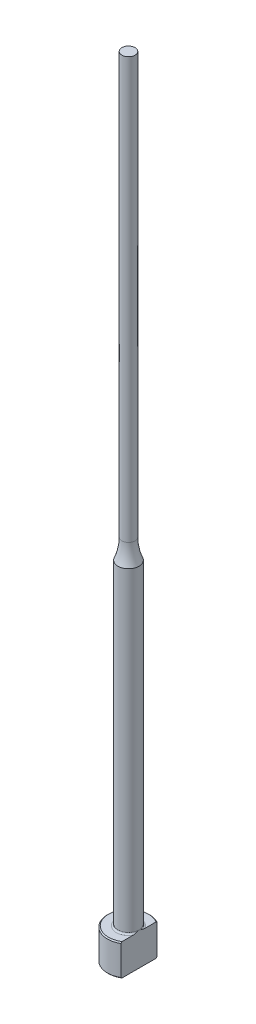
ISO-10303-21;
HEADER;
FILE_DESCRIPTION(('STEP AP214'),'2;1');
FILE_NAME('part.step','',(''),(''),'','','');
FILE_SCHEMA(('AUTOMOTIVE_DESIGN { 1 0 10303 214 1 1 1 1 }'));
ENDSEC;
DATA;
#1=APPLICATION_CONTEXT('core data for automotive mechanical design processes');
#2=APPLICATION_PROTOCOL_DEFINITION('international standard','automotive_design',2000,#1);
#3=PRODUCT_CONTEXT('',#1,'mechanical');
#4=PRODUCT('Part','Part','',(#3));
#5=PRODUCT_RELATED_PRODUCT_CATEGORY('part','',(#4));
#6=PRODUCT_DEFINITION_FORMATION('','',#4);
#7=PRODUCT_DEFINITION_CONTEXT('part definition',#1,'design');
#8=PRODUCT_DEFINITION('design','',#6,#7);
#9=PRODUCT_DEFINITION_SHAPE('','',#8);
#10=(LENGTH_UNIT() NAMED_UNIT(*) SI_UNIT(.MILLI.,.METRE.));
#11=(NAMED_UNIT(*) PLANE_ANGLE_UNIT() SI_UNIT($,.RADIAN.));
#12=(NAMED_UNIT(*) SI_UNIT($,.STERADIAN.) SOLID_ANGLE_UNIT());
#13=UNCERTAINTY_MEASURE_WITH_UNIT(LENGTH_MEASURE(1.E-05),#10,'distance_accuracy_value','');
#14=(GEOMETRIC_REPRESENTATION_CONTEXT(3) GLOBAL_UNCERTAINTY_ASSIGNED_CONTEXT((#13)) GLOBAL_UNIT_ASSIGNED_CONTEXT((#10,
#11,#12)) REPRESENTATION_CONTEXT('',''));
#15=CARTESIAN_POINT('',(0.,0.,0.));
#16=DIRECTION('',(0.,0.,1.));
#17=DIRECTION('',(1.,0.,0.));
#18=AXIS2_PLACEMENT_3D('',#15,#16,#17);
#19=CARTESIAN_POINT('',(-3.99999999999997,6.,0.));
#20=DIRECTION('',(0.,1.,0.));
#21=DIRECTION('',(0.,0.,1.));
#22=AXIS2_PLACEMENT_3D('',#19,#20,#21);
#23=PLANE('',#22);
#24=CARTESIAN_POINT('',(0.,6.,0.));
#25=DIRECTION('',(0.,1.,0.));
#26=DIRECTION('',(0.,0.,1.));
#27=AXIS2_PLACEMENT_3D('',#24,#25,#26);
#28=CIRCLE('',#27,3.79999999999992);
#29=CARTESIAN_POINT('',(1.99999999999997,6.,-3.23109888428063));
#30=VERTEX_POINT('',#29);
#31=CARTESIAN_POINT('',(1.99999999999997,6.,3.23109888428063));
#32=VERTEX_POINT('',#31);
#33=EDGE_CURVE('E187',#30,#32,#28,.T.);
#34=ORIENTED_EDGE('',*,*,#33,.T.);
#35=DIRECTION('',(0.,0.,-1.));
#36=VECTOR('',#35,1.);
#37=CARTESIAN_POINT('',(1.99999999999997,6.,0.));
#38=LINE('',#37,#36);
#39=CARTESIAN_POINT('',(1.99999999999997,5.99999999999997,1.13578166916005));
#40=VERTEX_POINT('',#39);
#41=EDGE_CURVE('E57',#32,#40,#38,.T.);
#42=ORIENTED_EDGE('',*,*,#41,.T.);
#43=CARTESIAN_POINT('',(0.,6.,0.));
#44=DIRECTION('',(0.,1.,0.));
#45=DIRECTION('',(0.,0.,1.));
#46=AXIS2_PLACEMENT_3D('',#43,#44,#45);
#47=CIRCLE('',#46,2.29999999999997);
#48=CARTESIAN_POINT('',(1.99999999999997,5.99999999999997,-1.13578166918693));
#49=VERTEX_POINT('',#48);
#50=EDGE_CURVE('E108',#40,#49,#47,.F.);
#51=ORIENTED_EDGE('',*,*,#50,.T.);
#52=EDGE_CURVE('E137',#49,#30,#38,.T.);
#53=ORIENTED_EDGE('',*,*,#52,.T.);
#54=EDGE_LOOP('',(#34,#42,#51,#53));
#55=FACE_BOUND('',#54,.T.);
#56=ADVANCED_FACE('F32',(#55),#23,.T.);
#57=CARTESIAN_POINT('',(0.,259.958771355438,0.));
#58=DIRECTION('',(0.,1.,0.));
#59=DIRECTION('',(0.,0.,1.));
#60=AXIS2_PLACEMENT_3D('',#57,#58,#59);
#61=CYLINDRICAL_SURFACE('',#60,3.99999999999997);
#62=CARTESIAN_POINT('',(0.,5.79999999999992,0.));
#63=DIRECTION('',(0.,1.,0.));
#64=DIRECTION('',(0.,0.,1.));
#65=AXIS2_PLACEMENT_3D('',#62,#63,#64);
#66=CIRCLE('',#65,3.99999999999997);
#67=CARTESIAN_POINT('',(1.99999999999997,5.79999999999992,3.46410161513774));
#68=VERTEX_POINT('',#67);
#69=CARTESIAN_POINT('',(1.99999999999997,5.79999999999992,-3.46410161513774));
#70=VERTEX_POINT('',#69);
#71=EDGE_CURVE('E105',#68,#70,#66,.F.);
#72=ORIENTED_EDGE('',*,*,#71,.T.);
#73=DIRECTION('',(0.,-1.,0.));
#74=VECTOR('',#73,1.);
#75=CARTESIAN_POINT('',(1.99999999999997,150.,-3.46410161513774));
#76=LINE('',#75,#74);
#77=CARTESIAN_POINT('',(1.99999999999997,0.199999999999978,-3.46410161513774));
#78=VERTEX_POINT('',#77);
#79=EDGE_CURVE('E193',#70,#78,#76,.T.);
#80=ORIENTED_EDGE('',*,*,#79,.T.);
#81=CARTESIAN_POINT('',(0.,0.199999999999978,0.));
#82=DIRECTION('',(0.,-1.,0.));
#83=DIRECTION('',(0.,0.,-1.));
#84=AXIS2_PLACEMENT_3D('',#81,#82,#83);
#85=CIRCLE('',#84,3.99999999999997);
#86=CARTESIAN_POINT('',(1.99999999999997,0.199999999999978,3.46410161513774));
#87=VERTEX_POINT('',#86);
#88=EDGE_CURVE('E100',#78,#87,#85,.F.);
#89=ORIENTED_EDGE('',*,*,#88,.T.);
#90=DIRECTION('',(0.,-1.,0.));
#91=VECTOR('',#90,1.);
#92=CARTESIAN_POINT('',(1.99999999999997,150.,3.46410161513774));
#93=LINE('',#92,#91);
#94=EDGE_CURVE('E93',#68,#87,#93,.T.);
#95=ORIENTED_EDGE('',*,*,#94,.F.);
#96=EDGE_LOOP('',(#72,#80,#89,#95));
#97=FACE_BOUND('',#96,.T.);
#98=ADVANCED_FACE('F158',(#97),#61,.T.);
#99=CARTESIAN_POINT('',(0.,0.,0.));
#100=DIRECTION('',(0.,-1.,0.));
#101=DIRECTION('',(0.,0.,-1.));
#102=AXIS2_PLACEMENT_3D('',#99,#100,#101);
#103=PLANE('',#102);
#104=CARTESIAN_POINT('',(0.,0.,0.));
#105=DIRECTION('',(0.,-1.,0.));
#106=DIRECTION('',(0.,0.,-1.));
#107=AXIS2_PLACEMENT_3D('',#104,#105,#106);
#108=CIRCLE('',#107,3.79999999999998);
#109=CARTESIAN_POINT('',(1.99999999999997,0.,3.2310988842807));
#110=VERTEX_POINT('',#109);
#111=CARTESIAN_POINT('',(1.99999999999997,0.,-3.2310988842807));
#112=VERTEX_POINT('',#111);
#113=EDGE_CURVE('E98',#110,#112,#108,.T.);
#114=ORIENTED_EDGE('',*,*,#113,.T.);
#115=DIRECTION('',(0.,0.,1.));
#116=VECTOR('',#115,1.);
#117=CARTESIAN_POINT('',(1.99999999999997,0.,3.46410161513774));
#118=LINE('',#117,#116);
#119=EDGE_CURVE('E83',#112,#110,#118,.T.);
#120=ORIENTED_EDGE('',*,*,#119,.T.);
#121=EDGE_LOOP('',(#114,#120));
#122=FACE_BOUND('',#121,.T.);
#123=ADVANCED_FACE('F103',(#122),#103,.T.);
#124=CARTESIAN_POINT('',(0.,6.00000000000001,0.));
#125=DIRECTION('',(0.,-1.,0.));
#126=DIRECTION('',(0.,0.,-1.));
#127=AXIS2_PLACEMENT_3D('',#124,#125,#126);
#128=CONICAL_SURFACE('',#127,3.79999999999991,0.785398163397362);
#129=ORIENTED_EDGE('',*,*,#71,.F.);
#130=CARTESIAN_POINT('',(1.99999999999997,1.91904532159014,7.62295524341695));
#131=CARTESIAN_POINT('',(1.99999999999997,2.08611243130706,7.4502239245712));
#132=CARTESIAN_POINT('',(1.99999999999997,2.25300024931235,7.27731861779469));
#133=CARTESIAN_POINT('',(1.99999999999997,2.58631125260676,6.93105655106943));
#134=CARTESIAN_POINT('',(1.99999999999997,2.75273443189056,6.75769978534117));
#135=CARTESIAN_POINT('',(1.99999999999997,3.08509080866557,6.41034692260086));
#136=CARTESIAN_POINT('',(1.99999999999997,3.25102371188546,6.23635054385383));
#137=CARTESIAN_POINT('',(1.99999999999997,3.5821559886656,5.88766284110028));
#138=CARTESIAN_POINT('',(1.99999999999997,3.74735536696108,5.71297152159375));
#139=CARTESIAN_POINT('',(1.99999999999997,4.07353855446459,5.36616839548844));
#140=CARTESIAN_POINT('',(1.99999999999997,4.23454099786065,5.19407412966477));
#141=CARTESIAN_POINT('',(1.99999999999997,4.55534102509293,4.84876663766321));
#142=CARTESIAN_POINT('',(1.99999999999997,4.71513861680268,4.67555341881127));
#143=CARTESIAN_POINT('',(1.99999999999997,5.03306183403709,4.32766569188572));
#144=CARTESIAN_POINT('',(1.99999999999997,5.1911878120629,4.15299150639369));
#145=CARTESIAN_POINT('',(1.99999999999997,5.50513944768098,3.80159134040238));
#146=CARTESIAN_POINT('',(1.99999999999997,5.66096519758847,3.62486544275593));
#147=CARTESIAN_POINT('',(1.99999999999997,5.90974646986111,3.33722425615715));
#148=CARTESIAN_POINT('',(1.99999999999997,6.00376148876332,3.22722645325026));
#149=CARTESIAN_POINT('',(1.99999999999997,6.19011825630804,3.00579987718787));
#150=CARTESIAN_POINT('',(1.99999999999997,6.28245983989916,2.89437096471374));
#151=CARTESIAN_POINT('',(1.99999999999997,6.46586188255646,2.66849662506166));
#152=CARTESIAN_POINT('',(1.99999999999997,6.55689849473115,2.5540317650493));
#153=CARTESIAN_POINT('',(1.99999999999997,6.73578809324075,2.32266819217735));
#154=CARTESIAN_POINT('',(1.99999999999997,6.82364184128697,2.20577007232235));
#155=CARTESIAN_POINT('',(1.99999999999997,6.99612756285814,1.96688707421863));
#156=CARTESIAN_POINT('',(1.99999999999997,7.08069035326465,1.84485190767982));
#157=CARTESIAN_POINT('',(1.99999999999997,7.2430026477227,1.59599329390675));
#158=CARTESIAN_POINT('',(1.99999999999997,7.32074277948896,1.46916359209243));
#159=CARTESIAN_POINT('',(1.99999999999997,7.42869763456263,1.27510066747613));
#160=CARTESIAN_POINT('',(1.99999999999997,7.46305374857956,1.21018943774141));
#161=CARTESIAN_POINT('',(1.99999999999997,7.52837146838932,1.07868835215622));
#162=CARTESIAN_POINT('',(1.99999999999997,7.5593324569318,1.01209819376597));
#163=CARTESIAN_POINT('',(1.99999999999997,7.64566860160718,0.809894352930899));
#164=CARTESIAN_POINT('',(1.99999999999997,7.69478214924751,0.671360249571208));
#165=CARTESIAN_POINT('',(1.99999999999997,7.7479482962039,0.463657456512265));
#166=CARTESIAN_POINT('',(1.99999999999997,7.76205065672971,0.397033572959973));
#167=CARTESIAN_POINT('',(1.99999999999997,7.78390371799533,0.262728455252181));
#168=CARTESIAN_POINT('',(1.99999999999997,7.79165498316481,0.19504731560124));
#169=CARTESIAN_POINT('',(1.99999999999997,7.80025690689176,0.0594528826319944));
#170=CARTESIAN_POINT('',(1.99999999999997,7.80112894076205,-0.00845903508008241));
#171=CARTESIAN_POINT('',(1.99999999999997,7.79596585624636,-0.144020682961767));
#172=CARTESIAN_POINT('',(1.99999999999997,7.78993016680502,-0.211670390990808));
#173=CARTESIAN_POINT('',(1.99999999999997,7.77145363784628,-0.345483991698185));
#174=CARTESIAN_POINT('',(1.99999999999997,7.75906777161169,-0.411655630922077));
#175=CARTESIAN_POINT('',(1.99999999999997,7.72866360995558,-0.542678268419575));
#176=CARTESIAN_POINT('',(1.99999999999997,7.71064463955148,-0.607529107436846));
#177=CARTESIAN_POINT('',(1.99999999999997,7.66972939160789,-0.736064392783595));
#178=CARTESIAN_POINT('',(1.99999999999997,7.64680564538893,-0.799739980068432));
#179=CARTESIAN_POINT('',(1.99999999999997,7.5970014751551,-0.925489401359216));
#180=CARTESIAN_POINT('',(1.99999999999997,7.57012185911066,-0.987563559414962));
#181=CARTESIAN_POINT('',(1.99999999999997,7.48443518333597,-1.17209020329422));
#182=CARTESIAN_POINT('',(1.99999999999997,7.42077407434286,-1.29228210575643));
#183=CARTESIAN_POINT('',(1.99999999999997,7.28502644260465,-1.52785770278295));
#184=CARTESIAN_POINT('',(1.99999999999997,7.21292931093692,-1.6432350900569));
#185=CARTESIAN_POINT('',(1.99999999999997,7.06281517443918,-1.8706938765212));
#186=CARTESIAN_POINT('',(1.99999999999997,6.98477595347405,-1.98276048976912));
#187=CARTESIAN_POINT('',(1.99999999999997,6.82481971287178,-2.20397837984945));
#188=CARTESIAN_POINT('',(1.99999999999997,6.74290465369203,-2.31313108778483));
#189=CARTESIAN_POINT('',(1.99999999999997,6.5751722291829,-2.5306854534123));
#190=CARTESIAN_POINT('',(1.99999999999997,6.48931769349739,-2.63905831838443));
#191=CARTESIAN_POINT('',(1.99999999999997,6.31548151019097,-2.85409686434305));
#192=CARTESIAN_POINT('',(1.99999999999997,6.22749963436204,-2.96076236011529));
#193=CARTESIAN_POINT('',(1.99999999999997,6.0501503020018,-3.17249211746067));
#194=CARTESIAN_POINT('',(1.99999999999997,5.96078672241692,-3.27755963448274));
#195=CARTESIAN_POINT('',(1.99999999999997,5.78082366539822,-3.48663191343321));
#196=CARTESIAN_POINT('',(1.99999999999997,5.69022416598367,-3.59063665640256));
#197=CARTESIAN_POINT('',(1.99999999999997,5.44796733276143,-3.86612439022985));
#198=CARTESIAN_POINT('',(1.99999999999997,5.29545972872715,-4.03685912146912));
#199=CARTESIAN_POINT('',(1.99999999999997,4.98858070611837,-4.37664803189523));
#200=CARTESIAN_POINT('',(1.99999999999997,4.834209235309,-4.54570216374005));
#201=CARTESIAN_POINT('',(1.99999999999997,4.52396102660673,-4.88271638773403));
#202=CARTESIAN_POINT('',(1.99999999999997,4.36808300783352,-5.05067529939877));
#203=CARTESIAN_POINT('',(1.99999999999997,4.05530513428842,-5.38563883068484));
#204=CARTESIAN_POINT('',(1.99999999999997,3.89840527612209,-5.55264344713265));
#205=CARTESIAN_POINT('',(1.99999999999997,3.59029018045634,-5.87905385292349));
#206=CARTESIAN_POINT('',(1.99999999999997,3.43910664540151,-6.03848959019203));
#207=CARTESIAN_POINT('',(1.99999999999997,3.13616436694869,-6.35681456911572));
#208=CARTESIAN_POINT('',(1.99999999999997,2.98440562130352,-6.5157038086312));
#209=CARTESIAN_POINT('',(1.99999999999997,2.68059501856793,-6.83286192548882));
#210=CARTESIAN_POINT('',(1.99999999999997,2.5285436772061,-6.99113129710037));
#211=CARTESIAN_POINT('',(1.99999999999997,2.22406035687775,-7.30730102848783));
#212=CARTESIAN_POINT('',(1.99999999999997,2.07162838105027,-7.46520139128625));
#213=CARTESIAN_POINT('',(1.99999999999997,1.91904532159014,-7.62295524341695));
#214=B_SPLINE_CURVE_WITH_KNOTS('',3,(#130,#131,#132,#133,#134,#135,#136,#137,#138,#139,#140,
#141,#142,#143,#144,#145,#146,#147,#148,#149,#150,#151,#152,#153,#154,#155,#156,#157,#158,#159,
#160,#161,#162,#163,#164,#165,#166,#167,#168,#169,#170,#171,#172,#173,#174,#175,#176,#177,#178,
#179,#180,#181,#182,#183,#184,#185,#186,#187,#188,#189,#190,#191,#192,#193,#194,#195,#196,#197,
#198,#199,#200,#201,#202,#203,#204,#205,#206,#207,#208,#209,#210,#211,#212,#213),.UNSPECIFIED.,
.F.,.F.,(4,2,2,2,2,2,2,2,2,2,2,2,2,2,2,2,2,2,2,2,2,2,2,2,2,2,2,2,2,2,2,2,2,2,2,2,2,2,2,2,2,4),
(0.,0.720921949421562,1.4418531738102,2.16315326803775,2.8844486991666,3.59144103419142,
4.29842874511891,5.00526427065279,5.7120713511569,6.14616174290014,6.58029471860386,
7.01901494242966,7.45762947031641,7.90290456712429,8.34878206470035,8.56901415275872,
8.78928621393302,9.228144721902,9.43219512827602,9.63622739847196,9.83962544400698,
10.0430403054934,10.244723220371,10.4464303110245,10.6492980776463,10.8521244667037,
11.2595582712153,11.6675100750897,12.0770700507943,12.4864250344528,12.9011677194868,
13.3159550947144,13.7297367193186,14.1435257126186,14.8302935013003,15.5170805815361,
16.2045145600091,16.891950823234,17.5511045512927,18.2102608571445,18.8686819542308,
19.5270976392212),.UNSPECIFIED.);
#215=EDGE_CURVE('E136',#68,#32,#214,.T.);
#216=ORIENTED_EDGE('',*,*,#215,.T.);
#217=ORIENTED_EDGE('',*,*,#33,.F.);
#218=EDGE_CURVE('E128',#30,#70,#214,.T.);
#219=ORIENTED_EDGE('',*,*,#218,.T.);
#220=EDGE_LOOP('',(#129,#216,#217,#219));
#221=FACE_BOUND('',#220,.T.);
#222=ADVANCED_FACE('F144',(#221),#128,.T.);
#223=CARTESIAN_POINT('',(0.,0.199999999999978,0.));
#224=DIRECTION('',(0.,1.,0.));
#225=DIRECTION('',(0.,0.,1.));
#226=AXIS2_PLACEMENT_3D('',#223,#224,#225);
#227=CONICAL_SURFACE('',#226,3.99999999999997,0.785398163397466);
#228=ORIENTED_EDGE('',*,*,#88,.F.);
#229=CARTESIAN_POINT('',(1.99999999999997,4.08095467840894,-7.62295524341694));
#230=CARTESIAN_POINT('',(1.99999999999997,3.91388756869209,-7.45022392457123));
#231=CARTESIAN_POINT('',(1.99999999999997,3.74699975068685,-7.27731861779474));
#232=CARTESIAN_POINT('',(1.99999999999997,3.41368874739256,-6.93105655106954));
#233=CARTESIAN_POINT('',(1.99999999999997,3.24726556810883,-6.7576997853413));
#234=CARTESIAN_POINT('',(1.99999999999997,2.91490919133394,-6.41034692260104));
#235=CARTESIAN_POINT('',(1.99999999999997,2.7489762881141,-6.23635054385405));
#236=CARTESIAN_POINT('',(1.99999999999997,2.41784401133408,-5.88766284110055));
#237=CARTESIAN_POINT('',(1.99999999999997,2.25264463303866,-5.71297152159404));
#238=CARTESIAN_POINT('',(1.99999999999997,1.92646144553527,-5.36616839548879));
#239=CARTESIAN_POINT('',(1.99999999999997,1.76545900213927,-5.19407412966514));
#240=CARTESIAN_POINT('',(1.99999999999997,1.44465897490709,-4.84876663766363));
#241=CARTESIAN_POINT('',(1.99999999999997,1.28486138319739,-4.67555341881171));
#242=CARTESIAN_POINT('',(1.99999999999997,0.966938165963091,-4.32766569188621));
#243=CARTESIAN_POINT('',(1.99999999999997,0.808812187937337,-4.1529915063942));
#244=CARTESIAN_POINT('',(1.99999999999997,0.494860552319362,-3.80159134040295));
#245=CARTESIAN_POINT('',(1.99999999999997,0.339034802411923,-3.62486544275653));
#246=CARTESIAN_POINT('',(1.99999999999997,0.0902535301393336,-3.33722425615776));
#247=CARTESIAN_POINT('',(1.99999999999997,-0.0037614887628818,-3.22722645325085));
#248=CARTESIAN_POINT('',(1.99999999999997,-0.190118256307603,-3.00579987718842));
#249=CARTESIAN_POINT('',(1.99999999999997,-0.282459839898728,-2.89437096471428));
#250=CARTESIAN_POINT('',(1.99999999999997,-0.465861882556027,-2.66849662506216));
#251=CARTESIAN_POINT('',(1.99999999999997,-0.556898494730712,-2.55403176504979));
#252=CARTESIAN_POINT('',(1.99999999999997,-0.735788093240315,-2.3226681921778));
#253=CARTESIAN_POINT('',(1.99999999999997,-0.823641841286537,-2.20577007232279));
#254=CARTESIAN_POINT('',(1.99999999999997,-0.996127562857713,-1.96688707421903));
#255=CARTESIAN_POINT('',(1.99999999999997,-1.08069035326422,-1.84485190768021));
#256=CARTESIAN_POINT('',(1.99999999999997,-1.24300264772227,-1.59599329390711));
#257=CARTESIAN_POINT('',(1.99999999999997,-1.32074277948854,-1.46916359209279));
#258=CARTESIAN_POINT('',(1.99999999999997,-1.42869763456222,-1.27510066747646));
#259=CARTESIAN_POINT('',(1.99999999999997,-1.46305374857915,-1.21018943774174));
#260=CARTESIAN_POINT('',(1.99999999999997,-1.52837146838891,-1.07868835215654));
#261=CARTESIAN_POINT('',(1.99999999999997,-1.5593324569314,-1.01209819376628));
#262=CARTESIAN_POINT('',(1.99999999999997,-1.64566860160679,-0.809894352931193));
#263=CARTESIAN_POINT('',(1.99999999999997,-1.69478214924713,-0.671360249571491));
#264=CARTESIAN_POINT('',(1.99999999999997,-1.74794829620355,-0.46365745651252));
#265=CARTESIAN_POINT('',(1.99999999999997,-1.76205065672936,-0.39703357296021));
#266=CARTESIAN_POINT('',(1.99999999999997,-1.783903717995,-0.26272845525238));
#267=CARTESIAN_POINT('',(1.99999999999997,-1.79165498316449,-0.195047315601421));
#268=CARTESIAN_POINT('',(1.99999999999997,-1.80025690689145,-0.0594528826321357));
#269=CARTESIAN_POINT('',(1.99999999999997,-1.80112894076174,0.00845903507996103));
#270=CARTESIAN_POINT('',(1.99999999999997,-1.79596585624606,0.144020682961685));
#271=CARTESIAN_POINT('',(1.99999999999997,-1.78993016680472,0.211670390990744));
#272=CARTESIAN_POINT('',(1.99999999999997,-1.77145363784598,0.345483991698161));
#273=CARTESIAN_POINT('',(1.99999999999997,-1.75906777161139,0.411655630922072));
#274=CARTESIAN_POINT('',(1.99999999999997,-1.72866360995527,0.542678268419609));
#275=CARTESIAN_POINT('',(1.99999999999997,-1.71064463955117,0.607529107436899));
#276=CARTESIAN_POINT('',(1.99999999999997,-1.66972939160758,0.736064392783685));
#277=CARTESIAN_POINT('',(1.99999999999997,-1.64680564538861,0.799739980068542));
#278=CARTESIAN_POINT('',(1.99999999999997,-1.59700147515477,0.925489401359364));
#279=CARTESIAN_POINT('',(1.99999999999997,-1.57012185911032,0.987563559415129));
#280=CARTESIAN_POINT('',(1.99999999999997,-1.4844351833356,1.17209020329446));
#281=CARTESIAN_POINT('',(1.99999999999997,-1.42077407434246,1.29228210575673));
#282=CARTESIAN_POINT('',(1.99999999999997,-1.2850264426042,1.52785770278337));
#283=CARTESIAN_POINT('',(1.99999999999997,-1.21292931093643,1.64323509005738));
#284=CARTESIAN_POINT('',(1.99999999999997,-1.06281517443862,1.87069387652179));
#285=CARTESIAN_POINT('',(1.99999999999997,-0.984775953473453,1.98276048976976));
#286=CARTESIAN_POINT('',(1.99999999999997,-0.824819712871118,2.2039783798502));
#287=CARTESIAN_POINT('',(1.99999999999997,-0.742904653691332,2.31313108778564));
#288=CARTESIAN_POINT('',(1.99999999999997,-0.575172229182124,2.53068545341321));
#289=CARTESIAN_POINT('',(1.99999999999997,-0.489317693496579,2.6390583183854));
#290=CARTESIAN_POINT('',(1.99999999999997,-0.315481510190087,2.85409686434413));
#291=CARTESIAN_POINT('',(1.99999999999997,-0.227499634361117,2.96076236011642));
#292=CARTESIAN_POINT('',(1.99999999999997,-0.0501503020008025,3.17249211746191));
#293=CARTESIAN_POINT('',(1.99999999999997,0.039213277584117,3.27755963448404));
#294=CARTESIAN_POINT('',(1.99999999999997,0.219176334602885,3.48663191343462));
#295=CARTESIAN_POINT('',(1.99999999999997,0.309775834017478,3.59063665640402));
#296=CARTESIAN_POINT('',(1.99999999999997,0.552032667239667,3.86612439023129));
#297=CARTESIAN_POINT('',(1.99999999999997,0.704540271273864,4.03685912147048));
#298=CARTESIAN_POINT('',(1.99999999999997,1.01141929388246,4.37664803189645));
#299=CARTESIAN_POINT('',(1.99999999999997,1.16579076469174,4.54570216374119));
#300=CARTESIAN_POINT('',(1.99999999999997,1.47603897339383,4.88271638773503));
#301=CARTESIAN_POINT('',(1.99999999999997,1.63191699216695,5.0506752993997));
#302=CARTESIAN_POINT('',(1.99999999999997,1.94469486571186,5.38563883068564));
#303=CARTESIAN_POINT('',(1.99999999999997,2.10159472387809,5.55264344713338));
#304=CARTESIAN_POINT('',(1.99999999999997,2.40970981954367,5.87905385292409));
#305=CARTESIAN_POINT('',(1.99999999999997,2.56089335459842,6.03848959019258));
#306=CARTESIAN_POINT('',(1.99999999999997,2.86383563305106,6.35681456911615));
#307=CARTESIAN_POINT('',(1.99999999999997,3.01559437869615,6.51570380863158));
#308=CARTESIAN_POINT('',(1.99999999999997,3.31940498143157,6.83286192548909));
#309=CARTESIAN_POINT('',(1.99999999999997,3.47145632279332,6.99113129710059));
#310=CARTESIAN_POINT('',(1.99999999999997,3.77593964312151,7.30730102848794));
#311=CARTESIAN_POINT('',(1.99999999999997,3.9283716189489,7.4652013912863));
#312=CARTESIAN_POINT('',(1.99999999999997,4.08095467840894,7.62295524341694));
#313=B_SPLINE_CURVE_WITH_KNOTS('',3,(#229,#230,#231,#232,#233,#234,#235,#236,#237,#238,#239,
#240,#241,#242,#243,#244,#245,#246,#247,#248,#249,#250,#251,#252,#253,#254,#255,#256,#257,#258,
#259,#260,#261,#262,#263,#264,#265,#266,#267,#268,#269,#270,#271,#272,#273,#274,#275,#276,#277,
#278,#279,#280,#281,#282,#283,#284,#285,#286,#287,#288,#289,#290,#291,#292,#293,#294,#295,#296,
#297,#298,#299,#300,#301,#302,#303,#304,#305,#306,#307,#308,#309,#310,#311,#312),.UNSPECIFIED.,
.F.,.F.,(4,2,2,2,2,2,2,2,2,2,2,2,2,2,2,2,2,2,2,2,2,2,2,2,2,2,2,2,2,2,2,2,2,2,2,2,2,2,2,2,2,4),
(0.,0.720921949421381,1.44185317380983,2.1631532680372,2.88444869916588,3.59144103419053,
4.29842874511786,5.00526427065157,5.71207135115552,6.1461617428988,6.58029471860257,
7.0190149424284,7.4576294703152,7.90290456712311,8.34878206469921,8.56901415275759,
8.78928621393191,9.22814472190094,9.43219512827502,9.63622739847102,9.83962544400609,
10.0430403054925,10.2447232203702,10.4464303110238,10.6492980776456,10.8521244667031,
11.2595582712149,11.6675100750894,12.0770700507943,12.486425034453,12.9011677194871,
13.3159550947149,13.7297367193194,14.1435257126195,14.8302935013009,15.5170805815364,
16.2045145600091,16.8919508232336,17.551104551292,18.2102608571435,18.8686819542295,
19.5270976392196),.UNSPECIFIED.);
#314=EDGE_CURVE('E86',#78,#112,#313,.T.);
#315=ORIENTED_EDGE('',*,*,#314,.T.);
#316=ORIENTED_EDGE('',*,*,#113,.F.);
#317=EDGE_CURVE('E89',#110,#87,#313,.T.);
#318=ORIENTED_EDGE('',*,*,#317,.T.);
#319=EDGE_LOOP('',(#228,#315,#316,#318));
#320=FACE_BOUND('',#319,.T.);
#321=ADVANCED_FACE('F97',(#320),#227,.T.);
#322=CARTESIAN_POINT('',(0.,6.29999999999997,0.));
#323=DIRECTION('',(0.,1.,0.));
#324=DIRECTION('',(0.,0.,1.));
#325=AXIS2_PLACEMENT_3D('',#322,#323,#324);
#326=TOROIDAL_SURFACE('',#325,2.29999999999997,0.3);
#327=CARTESIAN_POINT('',(1.99999999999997,6.29999999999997,0.));
#328=CARTESIAN_POINT('',(1.99999999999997,6.30000062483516,-7.91120119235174E-11));
#329=CARTESIAN_POINT('',(1.99999999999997,6.3000012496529,-1.38466953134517E-07));
#330=CARTESIAN_POINT('',(1.99999999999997,6.3000024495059,-5.72507056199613E-07));
#331=CARTESIAN_POINT('',(1.99999999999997,6.30000302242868,-8.72848936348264E-07));
#332=CARTESIAN_POINT('',(1.99999999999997,6.30000416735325,-1.59335938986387E-06));
#333=CARTESIAN_POINT('',(1.99999999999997,6.30000473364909,-2.02244692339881E-06));
#334=CARTESIAN_POINT('',(1.99999999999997,6.30000579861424,-2.94494844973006E-06));
#335=CARTESIAN_POINT('',(1.99999999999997,6.30000629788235,-3.4377030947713E-06));
#336=CARTESIAN_POINT('',(1.99999999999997,6.30000798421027,-5.21460072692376E-06));
#337=CARTESIAN_POINT('',(1.99999999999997,6.30000908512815,-6.58180911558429E-06));
#338=CARTESIAN_POINT('',(1.99999999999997,6.30001103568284,-9.3977532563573E-06));
#339=CARTESIAN_POINT('',(1.99999999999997,6.30001189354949,-1.08411101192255E-05));
#340=CARTESIAN_POINT('',(1.99999999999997,6.30001514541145,-1.65122775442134E-05));
#341=CARTESIAN_POINT('',(1.99999999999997,6.30001737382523,-2.08398783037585E-05));
#342=CARTESIAN_POINT('',(1.99999999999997,6.30002099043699,-2.93440763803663E-05));
#343=CARTESIAN_POINT('',(1.99999999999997,6.30002243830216,-3.34960297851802E-05));
#344=CARTESIAN_POINT('',(1.99999999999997,6.30002863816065,-5.12890573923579E-05));
#345=CARTESIAN_POINT('',(1.99999999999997,6.30003337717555,-6.49250938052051E-05));
#346=CARTESIAN_POINT('',(1.99999999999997,6.30004093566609,-9.03829827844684E-05));
#347=CARTESIAN_POINT('',(1.99999999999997,6.30004394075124,-0.000102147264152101));
#348=CARTESIAN_POINT('',(1.99999999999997,6.30006787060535,-0.000188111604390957));
#349=CARTESIAN_POINT('',(1.99999999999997,6.3000985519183,-0.000259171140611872));
#350=CARTESIAN_POINT('',(1.99999999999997,6.30021378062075,-0.00053614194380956));
#351=CARTESIAN_POINT('',(1.99999999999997,6.3002910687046,-0.000744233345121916));
#352=CARTESIAN_POINT('',(1.99999999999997,6.30059644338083,-0.00155446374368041));
#353=CARTESIAN_POINT('',(1.99999999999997,6.30083214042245,-0.00215436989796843));
#354=CARTESIAN_POINT('',(1.99999999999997,6.30179425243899,-0.00461477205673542));
#355=CARTESIAN_POINT('',(1.99999999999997,6.30251207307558,-0.00647773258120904));
#356=CARTESIAN_POINT('',(1.99999999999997,6.31311632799,-0.0339840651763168));
#357=CARTESIAN_POINT('',(1.99999999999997,6.32306890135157,-0.0596088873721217));
#358=CARTESIAN_POINT('',(1.99999999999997,6.34248629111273,-0.109946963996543));
#359=CARTESIAN_POINT('',(1.99999999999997,6.35195547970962,-0.134658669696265));
#360=CARTESIAN_POINT('',(1.99999999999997,6.37186796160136,-0.18704653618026));
#361=CARTESIAN_POINT('',(1.99999999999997,6.38229466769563,-0.214729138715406));
#362=CARTESIAN_POINT('',(1.99999999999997,6.40297705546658,-0.270480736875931));
#363=CARTESIAN_POINT('',(1.99999999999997,6.41322989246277,-0.298550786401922));
#364=CARTESIAN_POINT('',(1.99999999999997,6.43806738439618,-0.36800773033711));
#365=CARTESIAN_POINT('',(1.99999999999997,6.45243182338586,-0.409474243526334));
#366=CARTESIAN_POINT('',(1.99999999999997,6.47965482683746,-0.491807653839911));
#367=CARTESIAN_POINT('',(1.99999999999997,6.49254110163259,-0.532665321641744));
#368=CARTESIAN_POINT('',(1.99999999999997,6.51851192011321,-0.620554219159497));
#369=CARTESIAN_POINT('',(1.99999999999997,6.53137383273,-0.667652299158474));
#370=CARTESIAN_POINT('',(1.99999999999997,6.55459547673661,-0.762854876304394));
#371=CARTESIAN_POINT('',(1.99999999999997,6.5649353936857,-0.810964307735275));
#372=CARTESIAN_POINT('',(1.99999999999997,6.58270957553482,-0.910933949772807));
#373=CARTESIAN_POINT('',(1.99999999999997,6.58991426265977,-0.962836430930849));
#374=CARTESIAN_POINT('',(1.99999999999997,6.59906919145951,-1.06698400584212));
#375=CARTESIAN_POINT('',(1.99999999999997,6.60103790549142,-1.1192272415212));
#376=CARTESIAN_POINT('',(1.99999999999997,6.59819318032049,-1.21399009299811));
#377=CARTESIAN_POINT('',(1.99999999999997,6.59455548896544,-1.2565387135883));
#378=CARTESIAN_POINT('',(1.99999999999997,6.58116512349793,-1.34017723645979));
#379=CARTESIAN_POINT('',(1.99999999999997,6.57150205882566,-1.38127935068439));
#380=CARTESIAN_POINT('',(1.99999999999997,6.55087659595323,-1.44109771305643));
#381=CARTESIAN_POINT('',(1.99999999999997,6.5429124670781,-1.46084510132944));
#382=CARTESIAN_POINT('',(1.99999999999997,6.52453399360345,-1.49924523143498));
#383=CARTESIAN_POINT('',(1.99999999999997,6.51411538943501,-1.51789599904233));
#384=CARTESIAN_POINT('',(1.99999999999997,6.49255299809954,-1.55022658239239));
#385=CARTESIAN_POINT('',(1.99999999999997,6.48185951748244,-1.56420357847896));
#386=CARTESIAN_POINT('',(1.99999999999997,6.45839348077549,-1.5902875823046));
#387=CARTESIAN_POINT('',(1.99999999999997,6.445625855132,-1.60239889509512));
#388=CARTESIAN_POINT('',(1.99999999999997,6.4218327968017,-1.62093425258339));
#389=CARTESIAN_POINT('',(1.99999999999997,6.41131183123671,-1.6280029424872));
#390=CARTESIAN_POINT('',(1.99999999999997,6.38926242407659,-1.64036132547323));
#391=CARTESIAN_POINT('',(1.99999999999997,6.37773458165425,-1.64565206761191));
#392=CARTESIAN_POINT('',(1.99999999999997,6.35379760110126,-1.65410966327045));
#393=CARTESIAN_POINT('',(1.99999999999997,6.34138166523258,-1.65725762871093));
#394=CARTESIAN_POINT('',(1.99999999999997,6.31617371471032,-1.66106000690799));
#395=CARTESIAN_POINT('',(1.99999999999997,6.3033820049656,-1.66171638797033));
#396=CARTESIAN_POINT('',(1.99999999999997,6.27959278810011,-1.66055848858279));
#397=CARTESIAN_POINT('',(1.99999999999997,6.26857876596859,-1.6590551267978));
#398=CARTESIAN_POINT('',(1.99999999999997,6.24695777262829,-1.65423593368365));
#399=CARTESIAN_POINT('',(1.99999999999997,6.23635086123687,-1.65091983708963));
#400=CARTESIAN_POINT('',(1.99999999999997,6.21566894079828,-1.64264699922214));
#401=CARTESIAN_POINT('',(1.99999999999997,6.20560117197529,-1.63767239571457));
#402=CARTESIAN_POINT('',(1.99999999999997,6.18626855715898,-1.626364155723));
#403=CARTESIAN_POINT('',(1.99999999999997,6.17700400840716,-1.62003001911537));
#404=CARTESIAN_POINT('',(1.99999999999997,6.15429988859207,-1.60233802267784));
#405=CARTESIAN_POINT('',(1.99999999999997,6.14148777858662,-1.59017362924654));
#406=CARTESIAN_POINT('',(1.99999999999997,6.11794267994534,-1.56396532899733));
#407=CARTESIAN_POINT('',(1.99999999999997,6.10721625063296,-1.54991572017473));
#408=CARTESIAN_POINT('',(1.99999999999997,6.08234423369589,-1.51253200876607));
#409=CARTESIAN_POINT('',(1.99999999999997,6.06952968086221,-1.48831711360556));
#410=CARTESIAN_POINT('',(1.99999999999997,6.04773953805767,-1.43832020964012));
#411=CARTESIAN_POINT('',(1.99999999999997,6.03876197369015,-1.41253901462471));
#412=CARTESIAN_POINT('',(1.99999999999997,6.01850750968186,-1.3410181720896));
#413=CARTESIAN_POINT('',(1.99999999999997,6.01031623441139,-1.29441496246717));
#414=CARTESIAN_POINT('',(1.99999999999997,6.00061264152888,-1.19993212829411));
#415=CARTESIAN_POINT('',(1.99999999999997,5.99920833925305,-1.15204398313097));
#416=CARTESIAN_POINT('',(1.99999999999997,6.001930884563,-1.04246961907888));
#417=CARTESIAN_POINT('',(1.99999999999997,6.00779200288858,-0.980836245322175));
#418=CARTESIAN_POINT('',(1.99999999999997,6.0256292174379,-0.858294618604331));
#419=CARTESIAN_POINT('',(1.99999999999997,6.03763032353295,-0.797390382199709));
#420=CARTESIAN_POINT('',(1.99999999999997,6.0649490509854,-0.681046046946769));
#421=CARTESIAN_POINT('',(1.99999999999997,6.07996031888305,-0.625531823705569));
#422=CARTESIAN_POINT('',(1.99999999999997,6.11250087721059,-0.515805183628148));
#423=CARTESIAN_POINT('',(1.99999999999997,6.13000629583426,-0.461585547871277));
#424=CARTESIAN_POINT('',(1.99999999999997,6.15814737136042,-0.379074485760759));
#425=CARTESIAN_POINT('',(1.99999999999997,6.16814918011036,-0.350562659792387));
#426=CARTESIAN_POINT('',(1.99999999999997,6.18879761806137,-0.29295407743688));
#427=CARTESIAN_POINT('',(1.99999999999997,6.19945417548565,-0.263860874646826));
#428=CARTESIAN_POINT('',(1.99999999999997,6.21767622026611,-0.214869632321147));
#429=CARTESIAN_POINT('',(1.99999999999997,6.22516548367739,-0.19494302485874));
#430=CARTESIAN_POINT('',(1.99999999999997,6.24017206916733,-0.155327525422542));
#431=CARTESIAN_POINT('',(1.99999999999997,6.24768836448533,-0.135638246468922));
#432=CARTESIAN_POINT('',(1.99999999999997,6.26198776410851,-0.0983447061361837));
#433=CARTESIAN_POINT('',(1.99999999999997,6.26876515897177,-0.0807381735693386));
#434=CARTESIAN_POINT('',(1.99999999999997,6.2826325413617,-0.0448719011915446));
#435=CARTESIAN_POINT('',(1.99999999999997,6.28972459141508,-0.0266128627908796));
#436=CARTESIAN_POINT('',(1.99999999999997,6.29748742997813,-0.0064792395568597));
#437=CARTESIAN_POINT('',(1.99999999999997,6.29820461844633,-0.00461774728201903));
#438=CARTESIAN_POINT('',(1.99999999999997,6.29916656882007,-0.00215769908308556));
#439=CARTESIAN_POINT('',(1.99999999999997,6.29940270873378,-0.0015566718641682));
#440=CARTESIAN_POINT('',(1.99999999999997,6.29970861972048,-0.000745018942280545));
#441=CARTESIAN_POINT('',(1.99999999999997,6.29978601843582,-0.000536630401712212));
#442=CARTESIAN_POINT('',(1.99999999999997,6.29990139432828,-0.000259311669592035));
#443=CARTESIAN_POINT('',(1.99999999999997,6.29993209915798,-0.000188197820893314));
#444=CARTESIAN_POINT('',(1.99999999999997,6.29995604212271,-0.00010217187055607));
#445=CARTESIAN_POINT('',(1.99999999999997,6.29995904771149,-9.04035945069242E-05));
#446=CARTESIAN_POINT('',(1.99999999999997,6.29996660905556,-6.49368762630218E-05));
#447=CARTESIAN_POINT('',(1.99999999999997,6.2999713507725,-5.12961131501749E-05));
#448=CARTESIAN_POINT('',(1.99999999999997,6.29997755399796,-3.34977849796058E-05));
#449=CARTESIAN_POINT('',(1.99999999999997,6.29997900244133,-2.93452179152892E-05));
#450=CARTESIAN_POINT('',(1.99999999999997,6.29998262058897,-2.08398568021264E-05));
#451=CARTESIAN_POINT('',(1.99999999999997,6.2999848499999,-1.65117298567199E-05));
#452=CARTESIAN_POINT('',(1.99999999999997,6.29998810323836,-1.08400636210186E-05));
#453=CARTESIAN_POINT('',(1.99999999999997,6.29998896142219,-9.39665904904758E-06));
#454=CARTESIAN_POINT('',(1.99999999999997,6.29999091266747,-6.58068188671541E-06));
#455=CARTESIAN_POINT('',(1.99999999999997,6.29999201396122,-5.21349162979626E-06));
#456=CARTESIAN_POINT('',(1.99999999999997,6.29999370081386,-3.43669337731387E-06));
#457=CARTESIAN_POINT('',(1.99999999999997,6.29999420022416,-2.94398228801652E-06));
#458=CARTESIAN_POINT('',(1.99999999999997,6.29999526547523,-2.02159337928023E-06));
#459=CARTESIAN_POINT('',(1.99999999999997,6.29999583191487,-1.59257522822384E-06));
#460=CARTESIAN_POINT('',(1.99999999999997,6.29999697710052,-8.72232367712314E-07));
#461=CARTESIAN_POINT('',(1.99999999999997,6.29999755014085,-5.71985037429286E-07));
#462=CARTESIAN_POINT('',(1.99999999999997,6.29999875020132,-1.38175023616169E-07));
#463=CARTESIAN_POINT('',(1.99999999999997,6.29999937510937,7.91190278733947E-11));
#464=CARTESIAN_POINT('',(1.99999999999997,6.29999999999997,0.));
#465=B_SPLINE_CURVE_WITH_KNOTS('',3,(#327,#328,#329,#330,#331,#332,#333,#334,#335,#336,#337,
#338,#339,#340,#341,#342,#343,#344,#345,#346,#347,#348,#349,#350,#351,#352,#353,#354,#355,#356,
#357,#358,#359,#360,#361,#362,#363,#364,#365,#366,#367,#368,#369,#370,#371,#372,#373,#374,#375,
#376,#377,#378,#379,#380,#381,#382,#383,#384,#385,#386,#387,#388,#389,#390,#391,#392,#393,#394,
#395,#396,#397,#398,#399,#400,#401,#402,#403,#404,#405,#406,#407,#408,#409,#410,#411,#412,#413,
#414,#415,#416,#417,#418,#419,#420,#421,#422,#423,#424,#425,#426,#427,#428,#429,#430,#431,#432,
#433,#434,#435,#436,#437,#438,#439,#440,#441,#442,#443,#444,#445,#446,#447,#448,#449,#450,#451,
#452,#453,#454,#455,#456,#457,#458,#459,#460,#461,#462,#463,#464),.UNSPECIFIED.,.T.,.F.,(4,2,2,
2,2,2,2,2,2,2,2,2,2,2,2,2,2,2,2,2,2,2,2,2,2,2,2,2,2,2,2,2,2,2,2,2,2,2,2,2,2,2,2,2,2,2,2,2,2,2,2,
2,2,2,2,2,2,2,2,2,2,2,2,2,2,2,2,2,4),(0.,1.87392281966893E-06,3.80527467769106E-06,
5.92782295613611E-06,8.02992841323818E-06,1.32707961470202E-05,1.83039487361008E-05,
3.28629525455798E-05,4.60403129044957E-05,8.93409891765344E-05,0.000125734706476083,
0.000357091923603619,0.00102372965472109,0.00295649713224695,0.00894682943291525,
0.0914075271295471,0.170800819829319,0.259542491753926,0.349192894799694,0.480831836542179,
0.609336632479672,0.755749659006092,0.90327840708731,1.06029304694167,1.2167530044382,
1.34456674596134,1.47052354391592,1.53427785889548,1.59814364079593,1.65076980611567,
1.70327265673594,1.74115950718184,1.7790239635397,1.81721800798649,1.85538187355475,
1.88857073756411,1.92176445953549,1.95532789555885,1.98890369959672,2.04160283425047,
2.09446511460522,2.17619131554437,2.25787541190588,2.39903747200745,2.54243890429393,
2.72770087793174,2.91372355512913,3.08615579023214,3.2570365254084,3.34768022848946,
3.44062797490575,3.50449043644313,3.56771526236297,3.62431442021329,3.68307253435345,
3.68905809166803,3.69099447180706,3.69166206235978,3.69189359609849,3.69193000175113,
3.69197331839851,3.69198649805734,3.69200105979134,3.69200609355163,3.69201133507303,
3.69201343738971,3.69201556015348,3.69201749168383,3.69201936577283),.UNSPECIFIED.);
#466=CARTESIAN_POINT('',(1.99999999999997,6.29999999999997,0.));
#467=VERTEX_POINT('',#466);
#468=EDGE_CURVE('E11',#49,#467,#465,.T.);
#469=ORIENTED_EDGE('',*,*,#468,.F.);
#470=ORIENTED_EDGE('',*,*,#50,.F.);
#471=CARTESIAN_POINT('',(1.99999999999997,6.29999999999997,0.));
#472=CARTESIAN_POINT('',(1.99999999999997,6.29999937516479,7.91119678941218E-11));
#473=CARTESIAN_POINT('',(1.99999999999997,6.29999875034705,1.38466953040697E-07));
#474=CARTESIAN_POINT('',(1.99999999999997,6.29999755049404,5.72507056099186E-07));
#475=CARTESIAN_POINT('',(1.99999999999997,6.29999697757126,8.72848936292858E-07));
#476=CARTESIAN_POINT('',(1.99999999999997,6.29999583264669,1.5933593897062E-06));
#477=CARTESIAN_POINT('',(1.99999999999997,6.29999526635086,2.02244692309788E-06));
#478=CARTESIAN_POINT('',(1.99999999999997,6.29999420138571,2.94494844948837E-06));
#479=CARTESIAN_POINT('',(1.99999999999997,6.29999370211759,3.43770309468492E-06));
#480=CARTESIAN_POINT('',(1.99999999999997,6.29999201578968,5.2146007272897E-06));
#481=CARTESIAN_POINT('',(1.99999999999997,6.29999091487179,6.58180911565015E-06));
#482=CARTESIAN_POINT('',(1.99999999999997,6.29998896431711,9.39775325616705E-06));
#483=CARTESIAN_POINT('',(1.99999999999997,6.29998810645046,1.08411101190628E-05));
#484=CARTESIAN_POINT('',(1.99999999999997,6.2999848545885,1.65122775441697E-05));
#485=CARTESIAN_POINT('',(1.99999999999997,6.29998262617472,2.08398783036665E-05));
#486=CARTESIAN_POINT('',(1.99999999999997,6.29997900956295,2.93440763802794E-05));
#487=CARTESIAN_POINT('',(1.99999999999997,6.29997756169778,3.34960297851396E-05));
#488=CARTESIAN_POINT('',(1.99999999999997,6.2999713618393,5.12890573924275E-05));
#489=CARTESIAN_POINT('',(1.99999999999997,6.2999666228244,6.49250938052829E-05));
#490=CARTESIAN_POINT('',(1.99999999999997,6.29995906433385,9.03829827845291E-05));
#491=CARTESIAN_POINT('',(1.99999999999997,6.2999560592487,0.000102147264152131));
#492=CARTESIAN_POINT('',(1.99999999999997,6.29993212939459,0.000188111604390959));
#493=CARTESIAN_POINT('',(1.99999999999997,6.29990144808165,0.000259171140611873));
#494=CARTESIAN_POINT('',(1.99999999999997,6.2997862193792,0.000536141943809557));
#495=CARTESIAN_POINT('',(1.99999999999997,6.29970893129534,0.000744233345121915));
#496=CARTESIAN_POINT('',(1.99999999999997,6.29940355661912,0.00155446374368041));
#497=CARTESIAN_POINT('',(1.99999999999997,6.29916785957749,0.00215436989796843));
#498=CARTESIAN_POINT('',(1.99999999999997,6.29820574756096,0.00461477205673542));
#499=CARTESIAN_POINT('',(1.99999999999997,6.29748792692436,0.00647773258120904));
#500=CARTESIAN_POINT('',(1.99999999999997,6.28688367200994,0.0339840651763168));
#501=CARTESIAN_POINT('',(1.99999999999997,6.27693109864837,0.0596088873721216));
#502=CARTESIAN_POINT('',(1.99999999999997,6.25751370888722,0.109946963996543));
#503=CARTESIAN_POINT('',(1.99999999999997,6.24804452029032,0.134658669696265));
#504=CARTESIAN_POINT('',(1.99999999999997,6.22813203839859,0.187046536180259));
#505=CARTESIAN_POINT('',(1.99999999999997,6.21770533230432,0.214729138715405));
#506=CARTESIAN_POINT('',(1.99999999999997,6.19702294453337,0.270480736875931));
#507=CARTESIAN_POINT('',(1.99999999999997,6.18677010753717,0.298550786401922));
#508=CARTESIAN_POINT('',(1.99999999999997,6.16193261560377,0.36800773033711));
#509=CARTESIAN_POINT('',(1.99999999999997,6.14756817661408,0.409474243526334));
#510=CARTESIAN_POINT('',(1.99999999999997,6.12034517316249,0.491807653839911));
#511=CARTESIAN_POINT('',(1.99999999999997,6.10745889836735,0.532665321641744));
#512=CARTESIAN_POINT('',(1.99999999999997,6.08148807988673,0.620554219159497));
#513=CARTESIAN_POINT('',(1.99999999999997,6.06862616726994,0.667652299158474));
#514=CARTESIAN_POINT('',(1.99999999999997,6.04540452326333,0.762854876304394));
#515=CARTESIAN_POINT('',(1.99999999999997,6.03506460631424,0.810964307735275));
#516=CARTESIAN_POINT('',(1.99999999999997,6.01729042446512,0.910933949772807));
#517=CARTESIAN_POINT('',(1.99999999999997,6.01008573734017,0.962836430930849));
#518=CARTESIAN_POINT('',(1.99999999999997,6.00093080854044,1.06698400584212));
#519=CARTESIAN_POINT('',(1.99999999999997,5.99896209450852,1.1192272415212));
#520=CARTESIAN_POINT('',(1.99999999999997,6.00180681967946,1.21399009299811));
#521=CARTESIAN_POINT('',(1.99999999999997,6.0054445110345,1.2565387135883));
#522=CARTESIAN_POINT('',(1.99999999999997,6.01883487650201,1.34017723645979));
#523=CARTESIAN_POINT('',(1.99999999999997,6.02849794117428,1.38127935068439));
#524=CARTESIAN_POINT('',(1.99999999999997,6.04912340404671,1.44109771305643));
#525=CARTESIAN_POINT('',(1.99999999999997,6.05708753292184,1.46084510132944));
#526=CARTESIAN_POINT('',(1.99999999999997,6.07546600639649,1.49924523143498));
#527=CARTESIAN_POINT('',(1.99999999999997,6.08588461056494,1.51789599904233));
#528=CARTESIAN_POINT('',(1.99999999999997,6.1074470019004,1.55022658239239));
#529=CARTESIAN_POINT('',(1.99999999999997,6.1181404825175,1.56420357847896));
#530=CARTESIAN_POINT('',(1.99999999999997,6.14160651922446,1.5902875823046));
#531=CARTESIAN_POINT('',(1.99999999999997,6.15437414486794,1.60239889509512));
#532=CARTESIAN_POINT('',(1.99999999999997,6.17816720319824,1.62093425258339));
#533=CARTESIAN_POINT('',(1.99999999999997,6.18868816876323,1.6280029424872));
#534=CARTESIAN_POINT('',(1.99999999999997,6.21073757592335,1.64036132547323));
#535=CARTESIAN_POINT('',(1.99999999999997,6.2222654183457,1.64565206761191));
#536=CARTESIAN_POINT('',(1.99999999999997,6.24620239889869,1.65410966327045));
#537=CARTESIAN_POINT('',(1.99999999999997,6.25861833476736,1.65725762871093));
#538=CARTESIAN_POINT('',(1.99999999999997,6.28382628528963,1.66106000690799));
#539=CARTESIAN_POINT('',(1.99999999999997,6.29661799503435,1.66171638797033));
#540=CARTESIAN_POINT('',(1.99999999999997,6.32040721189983,1.66055848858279));
#541=CARTESIAN_POINT('',(1.99999999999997,6.33142123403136,1.6590551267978));
#542=CARTESIAN_POINT('',(1.99999999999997,6.35304222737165,1.65423593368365));
#543=CARTESIAN_POINT('',(1.99999999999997,6.36364913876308,1.65091983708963));
#544=CARTESIAN_POINT('',(1.99999999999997,6.38433105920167,1.64264699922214));
#545=CARTESIAN_POINT('',(1.99999999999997,6.39439882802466,1.63767239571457));
#546=CARTESIAN_POINT('',(1.99999999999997,6.41373144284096,1.626364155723));
#547=CARTESIAN_POINT('',(1.99999999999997,6.42299599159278,1.62003001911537));
#548=CARTESIAN_POINT('',(1.99999999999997,6.44570011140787,1.60233802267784));
#549=CARTESIAN_POINT('',(1.99999999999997,6.45851222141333,1.59017362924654));
#550=CARTESIAN_POINT('',(1.99999999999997,6.4820573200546,1.56396532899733));
#551=CARTESIAN_POINT('',(1.99999999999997,6.49278374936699,1.54991572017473));
#552=CARTESIAN_POINT('',(1.99999999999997,6.51765576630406,1.51253200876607));
#553=CARTESIAN_POINT('',(1.99999999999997,6.53047031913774,1.48831711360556));
#554=CARTESIAN_POINT('',(1.99999999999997,6.55226046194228,1.43832020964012));
#555=CARTESIAN_POINT('',(1.99999999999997,6.56123802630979,1.41253901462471));
#556=CARTESIAN_POINT('',(1.99999999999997,6.58149249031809,1.3410181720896));
#557=CARTESIAN_POINT('',(1.99999999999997,6.58968376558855,1.29441496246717));
#558=CARTESIAN_POINT('',(1.99999999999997,6.59938735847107,1.19993212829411));
#559=CARTESIAN_POINT('',(1.99999999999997,6.60079166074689,1.15204398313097));
#560=CARTESIAN_POINT('',(1.99999999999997,6.59806911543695,1.04246961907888));
#561=CARTESIAN_POINT('',(1.99999999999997,6.59220799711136,0.980836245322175));
#562=CARTESIAN_POINT('',(1.99999999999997,6.57437078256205,0.858294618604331));
#563=CARTESIAN_POINT('',(1.99999999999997,6.562369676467,0.797390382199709));
#564=CARTESIAN_POINT('',(1.99999999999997,6.53505094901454,0.681046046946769));
#565=CARTESIAN_POINT('',(1.99999999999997,6.52003968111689,0.625531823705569));
#566=CARTESIAN_POINT('',(1.99999999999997,6.48749912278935,0.515805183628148));
#567=CARTESIAN_POINT('',(1.99999999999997,6.46999370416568,0.461585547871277));
#568=CARTESIAN_POINT('',(1.99999999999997,6.44185262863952,0.379074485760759));
#569=CARTESIAN_POINT('',(1.99999999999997,6.43185081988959,0.350562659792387));
#570=CARTESIAN_POINT('',(1.99999999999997,6.41120238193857,0.29295407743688));
#571=CARTESIAN_POINT('',(1.99999999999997,6.40054582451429,0.263860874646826));
#572=CARTESIAN_POINT('',(1.99999999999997,6.38232377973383,0.214869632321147));
#573=CARTESIAN_POINT('',(1.99999999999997,6.37483451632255,0.194943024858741));
#574=CARTESIAN_POINT('',(1.99999999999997,6.35982793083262,0.155327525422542));
#575=CARTESIAN_POINT('',(1.99999999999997,6.35231163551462,0.135638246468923));
#576=CARTESIAN_POINT('',(1.99999999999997,6.33801223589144,0.0983447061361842));
#577=CARTESIAN_POINT('',(1.99999999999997,6.33123484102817,0.0807381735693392));
#578=CARTESIAN_POINT('',(1.99999999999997,6.31736745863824,0.044871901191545));
#579=CARTESIAN_POINT('',(1.99999999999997,6.31027540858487,0.0266128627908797));
#580=CARTESIAN_POINT('',(1.99999999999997,6.30251257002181,0.00647923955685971));
#581=CARTESIAN_POINT('',(1.99999999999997,6.30179538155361,0.00461774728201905));
#582=CARTESIAN_POINT('',(1.99999999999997,6.30083343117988,0.00215769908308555));
#583=CARTESIAN_POINT('',(1.99999999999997,6.30059729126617,0.00155667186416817));
#584=CARTESIAN_POINT('',(1.99999999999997,6.30029138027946,0.000745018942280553));
#585=CARTESIAN_POINT('',(1.99999999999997,6.30021398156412,0.000536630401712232));
#586=CARTESIAN_POINT('',(1.99999999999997,6.30009860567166,0.000259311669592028));
#587=CARTESIAN_POINT('',(1.99999999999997,6.30006790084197,0.000188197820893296));
#588=CARTESIAN_POINT('',(1.99999999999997,6.30004395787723,0.000102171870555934));
#589=CARTESIAN_POINT('',(1.99999999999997,6.30004095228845,9.04035945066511E-05));
#590=CARTESIAN_POINT('',(1.99999999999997,6.30003339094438,6.49368762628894E-05));
#591=CARTESIAN_POINT('',(1.99999999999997,6.30002864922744,5.12961131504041E-05));
#592=CARTESIAN_POINT('',(1.99999999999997,6.30002244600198,3.34977849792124E-05));
#593=CARTESIAN_POINT('',(1.99999999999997,6.30002099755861,2.93452179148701E-05));
#594=CARTESIAN_POINT('',(1.99999999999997,6.30001737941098,2.08398568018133E-05));
#595=CARTESIAN_POINT('',(1.99999999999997,6.30001515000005,1.65117298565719E-05));
#596=CARTESIAN_POINT('',(1.99999999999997,6.30001189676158,1.08400636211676E-05));
#597=CARTESIAN_POINT('',(1.99999999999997,6.30001103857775,9.39665904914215E-06));
#598=CARTESIAN_POINT('',(1.99999999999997,6.30000908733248,6.58068188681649E-06));
#599=CARTESIAN_POINT('',(1.99999999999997,6.30000798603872,5.21349162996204E-06));
#600=CARTESIAN_POINT('',(1.99999999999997,6.30000629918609,3.43669337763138E-06));
#601=CARTESIAN_POINT('',(1.99999999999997,6.30000579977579,2.94398228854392E-06));
#602=CARTESIAN_POINT('',(1.99999999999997,6.30000473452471,2.02159337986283E-06));
#603=CARTESIAN_POINT('',(1.99999999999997,6.30000416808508,1.59257522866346E-06));
#604=CARTESIAN_POINT('',(1.99999999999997,6.30000302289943,8.72232367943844E-07));
#605=CARTESIAN_POINT('',(1.99999999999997,6.30000244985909,5.71985037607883E-07));
#606=CARTESIAN_POINT('',(1.99999999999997,6.30000124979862,1.38175023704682E-07));
#607=CARTESIAN_POINT('',(1.99999999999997,6.30000062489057,-7.91189838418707E-11));
#608=CARTESIAN_POINT('',(1.99999999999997,6.29999999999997,0.));
#609=B_SPLINE_CURVE_WITH_KNOTS('',3,(#471,#472,#473,#474,#475,#476,#477,#478,#479,#480,#481,
#482,#483,#484,#485,#486,#487,#488,#489,#490,#491,#492,#493,#494,#495,#496,#497,#498,#499,#500,
#501,#502,#503,#504,#505,#506,#507,#508,#509,#510,#511,#512,#513,#514,#515,#516,#517,#518,#519,
#520,#521,#522,#523,#524,#525,#526,#527,#528,#529,#530,#531,#532,#533,#534,#535,#536,#537,#538,
#539,#540,#541,#542,#543,#544,#545,#546,#547,#548,#549,#550,#551,#552,#553,#554,#555,#556,#557,
#558,#559,#560,#561,#562,#563,#564,#565,#566,#567,#568,#569,#570,#571,#572,#573,#574,#575,#576,
#577,#578,#579,#580,#581,#582,#583,#584,#585,#586,#587,#588,#589,#590,#591,#592,#593,#594,#595,
#596,#597,#598,#599,#600,#601,#602,#603,#604,#605,#606,#607,#608),.UNSPECIFIED.,.T.,.F.,(4,2,2,
2,2,2,2,2,2,2,2,2,2,2,2,2,2,2,2,2,2,2,2,2,2,2,2,2,2,2,2,2,2,2,2,2,2,2,2,2,2,2,2,2,2,2,2,2,2,2,2,
2,2,2,2,2,2,2,2,2,2,2,2,2,2,2,2,2,4),(0.,1.87392281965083E-06,3.80527467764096E-06,
5.9278229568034E-06,8.02992841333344E-06,1.32707961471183E-05,1.83039487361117E-05,
3.28629525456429E-05,4.6040312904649E-05,8.93409891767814E-05,0.000125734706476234,
0.00035709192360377,0.00102372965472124,0.00295649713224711,0.0089468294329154,
0.091407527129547,0.170800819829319,0.259542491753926,0.349192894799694,0.480831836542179,
0.609336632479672,0.755749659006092,0.90327840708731,1.06029304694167,1.2167530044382,
1.34456674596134,1.47052354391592,1.53427785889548,1.59814364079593,1.65076980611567,
1.70327265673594,1.74115950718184,1.7790239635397,1.81721800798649,1.85538187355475,
1.88857073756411,1.92176445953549,1.95532789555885,1.98890369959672,2.04160283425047,
2.09446511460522,2.17619131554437,2.25787541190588,2.39903747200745,2.54243890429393,
2.72770087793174,2.91372355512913,3.08615579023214,3.2570365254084,3.34768022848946,
3.44062797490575,3.50449043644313,3.56771526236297,3.62431442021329,3.68307253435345,
3.68905809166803,3.69099447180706,3.69166206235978,3.69189359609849,3.69193000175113,
3.69197331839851,3.69198649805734,3.69200105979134,3.69200609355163,3.69201133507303,
3.69201343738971,3.69201556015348,3.69201749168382,3.69201936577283),.UNSPECIFIED.);
#610=EDGE_CURVE('E46',#467,#40,#609,.T.);
#611=ORIENTED_EDGE('',*,*,#610,.F.);
#612=CARTESIAN_POINT('',(0.,6.29999999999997,0.));
#613=DIRECTION('',(0.,1.,0.));
#614=DIRECTION('',(0.,0.,1.));
#615=AXIS2_PLACEMENT_3D('',#612,#613,#614);
#616=CIRCLE('',#615,1.99999999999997);
#617=EDGE_CURVE('E104',#467,#467,#616,.T.);
#618=ORIENTED_EDGE('',*,*,#617,.F.);
#619=EDGE_LOOP('',(#469,#470,#611,#618));
#620=FACE_BOUND('',#619,.T.);
#621=ADVANCED_FACE('F34',(#620),#326,.F.);
#622=CARTESIAN_POINT('',(-1.24999999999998,150.,0.));
#623=DIRECTION('',(0.,1.,0.));
#624=DIRECTION('',(0.,0.,1.));
#625=AXIS2_PLACEMENT_3D('',#622,#623,#624);
#626=PLANE('',#625);
#627=CARTESIAN_POINT('',(0.,150.,0.));
#628=DIRECTION('',(0.,1.,0.));
#629=DIRECTION('',(0.,0.,1.));
#630=AXIS2_PLACEMENT_3D('',#627,#628,#629);
#631=CIRCLE('',#630,1.24999999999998);
#632=CARTESIAN_POINT('',(0.,150.,1.24999999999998));
#633=VERTEX_POINT('',#632);
#634=EDGE_CURVE('E186',#633,#633,#631,.T.);
#635=ORIENTED_EDGE('',*,*,#634,.T.);
#636=EDGE_LOOP('',(#635));
#637=FACE_BOUND('',#636,.T.);
#638=ADVANCED_FACE('F149',(#637),#626,.T.);
#639=CARTESIAN_POINT('',(0.,259.958771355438,0.));
#640=DIRECTION('',(0.,1.,0.));
#641=DIRECTION('',(0.,0.,1.));
#642=AXIS2_PLACEMENT_3D('',#639,#640,#641);
#643=CYLINDRICAL_SURFACE('',#642,1.24999999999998);
#644=CARTESIAN_POINT('',(0.,70.,0.));
#645=DIRECTION('',(0.,1.,0.));
#646=DIRECTION('',(0.,0.,1.));
#647=AXIS2_PLACEMENT_3D('',#644,#645,#646);
#648=CIRCLE('',#647,1.24999999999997);
#649=CARTESIAN_POINT('',(0.,70.,1.24999999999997));
#650=VERTEX_POINT('',#649);
#651=EDGE_CURVE('E183',#650,#650,#648,.T.);
#652=ORIENTED_EDGE('',*,*,#651,.T.);
#653=EDGE_LOOP('',(#652));
#654=FACE_BOUND('',#653,.T.);
#655=ORIENTED_EDGE('',*,*,#634,.F.);
#656=EDGE_LOOP('',(#655));
#657=FACE_BOUND('',#656,.T.);
#658=ADVANCED_FACE('F172',(#654,#657),#643,.T.);
#659=CARTESIAN_POINT('',(0.,70.,0.));
#660=DIRECTION('',(0.,1.,0.));
#661=DIRECTION('',(0.,0.,1.));
#662=AXIS2_PLACEMENT_3D('',#659,#660,#661);
#663=TOROIDAL_SURFACE('',#662,11.25,10.);
#664=CARTESIAN_POINT('',(0.,66.2003289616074,0.));
#665=DIRECTION('',(0.,1.,0.));
#666=DIRECTION('',(0.,0.,1.));
#667=AXIS2_PLACEMENT_3D('',#664,#665,#666);
#668=CIRCLE('',#667,1.99999999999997);
#669=CARTESIAN_POINT('',(0.,66.2003289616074,1.99999999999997));
#670=VERTEX_POINT('',#669);
#671=EDGE_CURVE('E101',#670,#670,#668,.T.);
#672=ORIENTED_EDGE('',*,*,#671,.T.);
#673=EDGE_LOOP('',(#672));
#674=FACE_BOUND('',#673,.T.);
#675=ORIENTED_EDGE('',*,*,#651,.F.);
#676=EDGE_LOOP('',(#675));
#677=FACE_BOUND('',#676,.T.);
#678=ADVANCED_FACE('F169',(#674,#677),#663,.F.);
#679=CARTESIAN_POINT('',(0.,259.958771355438,0.));
#680=DIRECTION('',(0.,1.,0.));
#681=DIRECTION('',(0.,0.,1.));
#682=AXIS2_PLACEMENT_3D('',#679,#680,#681);
#683=CYLINDRICAL_SURFACE('',#682,1.99999999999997);
#684=ORIENTED_EDGE('',*,*,#617,.T.);
#685=EDGE_LOOP('',(#684));
#686=FACE_BOUND('',#685,.T.);
#687=ORIENTED_EDGE('',*,*,#671,.F.);
#688=EDGE_LOOP('',(#687));
#689=FACE_BOUND('',#688,.T.);
#690=ADVANCED_FACE('F122',(#686,#689),#683,.T.);
#691=CARTESIAN_POINT('',(1.99999999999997,150.,3.46410161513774));
#692=DIRECTION('',(1.,0.,0.));
#693=DIRECTION('',(0.,0.,-1.));
#694=AXIS2_PLACEMENT_3D('',#691,#692,#693);
#695=PLANE('',#694);
#696=ORIENTED_EDGE('',*,*,#79,.F.);
#697=ORIENTED_EDGE('',*,*,#218,.F.);
#698=ORIENTED_EDGE('',*,*,#52,.F.);
#699=ORIENTED_EDGE('',*,*,#468,.T.);
#700=ORIENTED_EDGE('',*,*,#610,.T.);
#701=ORIENTED_EDGE('',*,*,#41,.F.);
#702=ORIENTED_EDGE('',*,*,#215,.F.);
#703=ORIENTED_EDGE('',*,*,#94,.T.);
#704=ORIENTED_EDGE('',*,*,#317,.F.);
#705=ORIENTED_EDGE('',*,*,#119,.F.);
#706=ORIENTED_EDGE('',*,*,#314,.F.);
#707=EDGE_LOOP('',(#696,#697,#698,#699,#700,#701,#702,#703,#704,#705,#706));
#708=FACE_BOUND('',#707,.T.);
#709=ADVANCED_FACE('F85',(#708),#695,.T.);
#710=CLOSED_SHELL('',(#56,#98,#123,#222,#321,#621,#638,#658,#678,#690,#709));
#711=MANIFOLD_SOLID_BREP('B2',#710);
#712=ADVANCED_BREP_SHAPE_REPRESENTATION('',(#18,#711),#14);
#713=SHAPE_DEFINITION_REPRESENTATION(#9,#712);
ENDSEC;
END-ISO-10303-21;
